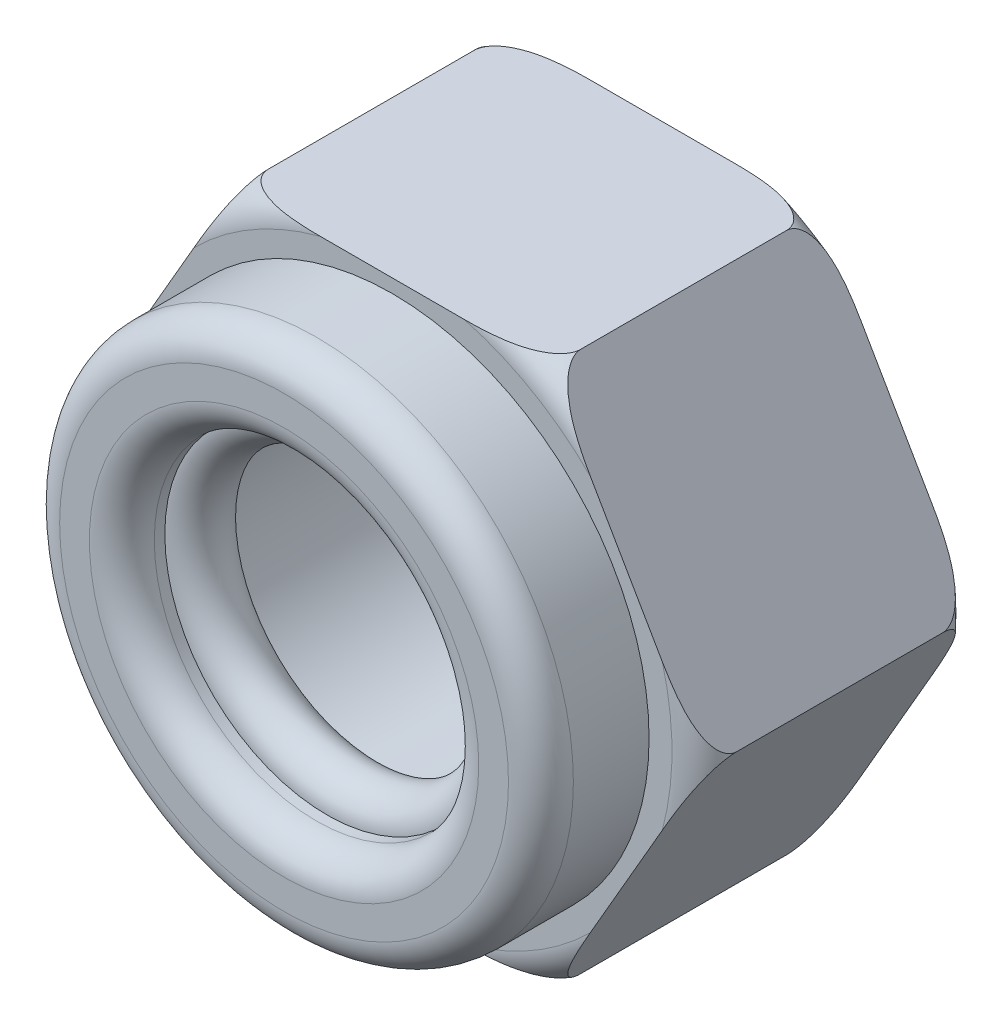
from build123d import *

# Parameters (mm, degrees)
ESQUISSE1_R        = 1.5
BOSS_EXTRU_1_DEPTH = 2.5
ESQUISSE2_R        = 2.375
ESQUISSE2_R_2      = 1.5
BOSS_EXTRU_2_DEPTH = 1
CONG_1_R           = 0.3
ESQUISSE4_R        = 0.271004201


with BuildPart() as part:
    # Esquisse1 → Boss.-Extru.1 (new body)
    with BuildSketch(Plane.XY):
        Polygon((2.886751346, 0), (1.443375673, 2.5), (-1.443375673, 2.5), (-2.886751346, 0), (-1.443375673, -2.5), (1.443375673, -2.5), align=None)
        Circle(ESQUISSE1_R, mode=Mode.SUBTRACT)
    extrude(amount=BOSS_EXTRU_1_DEPTH)

    # Esquisse2 → Boss.-Extru.2 (add)
    with BuildSketch(Plane.XY.offset(2.5)):
        Circle(ESQUISSE2_R)
        Circle(ESQUISSE2_R_2, mode=Mode.SUBTRACT)
    extrude(amount=BOSS_EXTRU_2_DEPTH)

    # Cong_1
    cong_1_edges = [part.edges().sort_by_distance(p)[0] for p in [
        (-2.375, 0, 3.5),
        (-1.5, 0, 3.5),
    ]]
    fillet(cong_1_edges, radius=CONG_1_R)

    # Esquisse3 → Enl_vement de mati_re-R_volution1 (revolve, cut)
    with BuildSketch(Plane(origin=(0, 0, 0), x_dir=(1, 0, 0), z_dir=(0, 1, 0))):
        with BuildLine():
            Line((2.886751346, -2.2), (2.886751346, -2.5))
            Line((2.886751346, -2.5), (2.586751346, -2.5))
            ThreePointArc((2.586751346, -2.5), (2.79888338, -2.412132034), (2.886751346, -2.2))
        make_face()
        with BuildLine():
            Line((2.886751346, 0), (2.586751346, 0))
            ThreePointArc((2.586751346, 0), (2.79888338, -0.087867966), (2.886751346, -0.3))
            Line((2.886751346, -0.3), (2.886751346, 0))
        make_face()
    revolve(axis=Axis((0, 0, 0), (0, 0, 1)), mode=Mode.SUBTRACT)

    # Esquisse4 → R_volution1 (revolve)
    with BuildSketch(Plane(origin=(0, 0, 0), x_dir=(1, 0, 0), z_dir=(0, 1, 0)), mode=Mode.PRIVATE) as r_volution1_sk:
        with Locations((1.5, -2.831669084)):
            Circle(ESQUISSE4_R)
    revolve(r_volution1_sk.sketch.rotate(Axis((0, 0, 0), (0, 0, 1)), 180), axis=Axis((0, 0, 0), (0, 0, 1)))


solid = part.part
